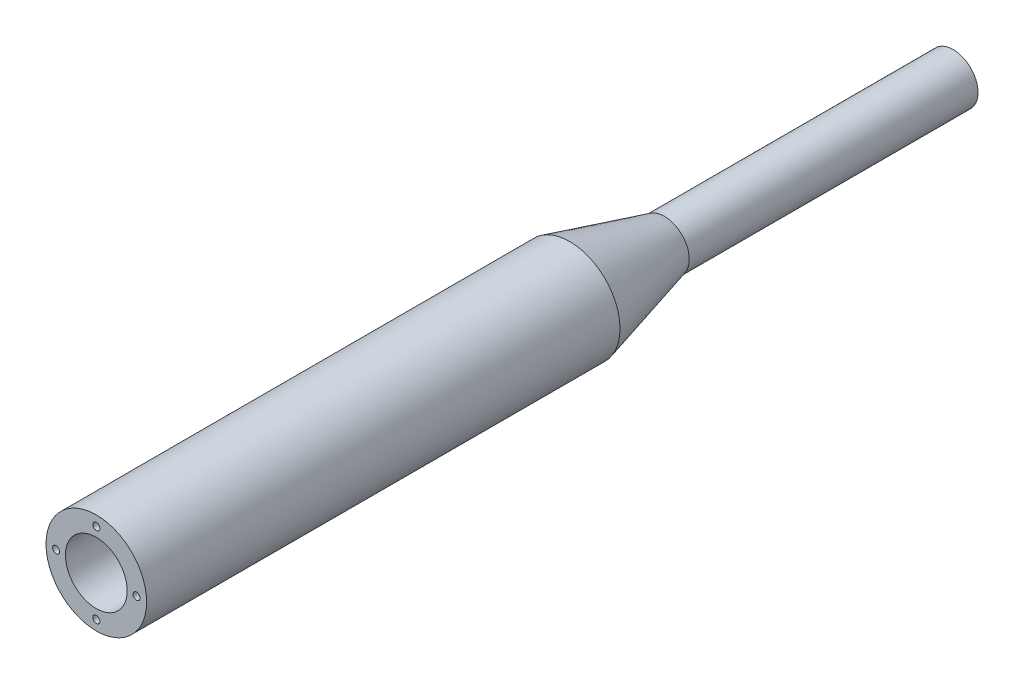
ISO-10303-21;
HEADER;
FILE_DESCRIPTION(('STEP AP214'),'2;1');
FILE_NAME('part.step','',(''),(''),'','','');
FILE_SCHEMA(('AUTOMOTIVE_DESIGN { 1 0 10303 214 1 1 1 1 }'));
ENDSEC;
DATA;
#1=APPLICATION_CONTEXT('core data for automotive mechanical design processes');
#2=APPLICATION_PROTOCOL_DEFINITION('international standard','automotive_design',2000,#1);
#3=PRODUCT_CONTEXT('',#1,'mechanical');
#4=PRODUCT('Part','Part','',(#3));
#5=PRODUCT_RELATED_PRODUCT_CATEGORY('part','',(#4));
#6=PRODUCT_DEFINITION_FORMATION('','',#4);
#7=PRODUCT_DEFINITION_CONTEXT('part definition',#1,'design');
#8=PRODUCT_DEFINITION('design','',#6,#7);
#9=PRODUCT_DEFINITION_SHAPE('','',#8);
#10=(LENGTH_UNIT() NAMED_UNIT(*) SI_UNIT(.MILLI.,.METRE.));
#11=(NAMED_UNIT(*) PLANE_ANGLE_UNIT() SI_UNIT($,.RADIAN.));
#12=(NAMED_UNIT(*) SI_UNIT($,.STERADIAN.) SOLID_ANGLE_UNIT());
#13=UNCERTAINTY_MEASURE_WITH_UNIT(LENGTH_MEASURE(1.E-05),#10,'distance_accuracy_value','');
#14=(GEOMETRIC_REPRESENTATION_CONTEXT(3) GLOBAL_UNCERTAINTY_ASSIGNED_CONTEXT((#13)) GLOBAL_UNIT_ASSIGNED_CONTEXT((#10,
#11,#12)) REPRESENTATION_CONTEXT('',''));
#15=CARTESIAN_POINT('',(0.,0.,0.));
#16=DIRECTION('',(0.,0.,1.));
#17=DIRECTION('',(1.,0.,0.));
#18=AXIS2_PLACEMENT_3D('',#15,#16,#17);
#19=CARTESIAN_POINT('',(0.,0.,254.));
#20=DIRECTION('',(0.,0.,1.));
#21=DIRECTION('',(1.,0.,0.));
#22=AXIS2_PLACEMENT_3D('',#19,#20,#21);
#23=CYLINDRICAL_SURFACE('',#22,15.875);
#24=CARTESIAN_POINT('',(0.,0.,0.));
#25=DIRECTION('',(0.,0.,1.));
#26=DIRECTION('',(1.,0.,0.));
#27=AXIS2_PLACEMENT_3D('',#24,#25,#26);
#28=CIRCLE('',#27,15.875);
#29=CARTESIAN_POINT('',(15.875,0.,0.));
#30=VERTEX_POINT('',#29);
#31=EDGE_CURVE('E98',#30,#30,#28,.T.);
#32=ORIENTED_EDGE('',*,*,#31,.F.);
#33=EDGE_LOOP('',(#32));
#34=FACE_BOUND('',#33,.T.);
#35=CARTESIAN_POINT('',(0.,0.,228.6));
#36=DIRECTION('',(0.,0.,1.));
#37=DIRECTION('',(1.,0.,0.));
#38=AXIS2_PLACEMENT_3D('',#35,#36,#37);
#39=CIRCLE('',#38,15.875);
#40=CARTESIAN_POINT('',(15.875,0.,228.6));
#41=VERTEX_POINT('',#40);
#42=EDGE_CURVE('E40',#41,#41,#39,.F.);
#43=ORIENTED_EDGE('',*,*,#42,.F.);
#44=EDGE_LOOP('',(#43));
#45=FACE_BOUND('',#44,.T.);
#46=ADVANCED_FACE('F36',(#34,#45),#23,.F.);
#47=CARTESIAN_POINT('',(0.,0.,254.));
#48=DIRECTION('',(0.,0.,-1.));
#49=DIRECTION('',(-1.,0.,0.));
#50=AXIS2_PLACEMENT_3D('',#47,#48,#49);
#51=CYLINDRICAL_SURFACE('',#50,26.9875);
#52=CARTESIAN_POINT('',(0.,0.,254.));
#53=DIRECTION('',(0.,0.,1.));
#54=DIRECTION('',(1.,0.,0.));
#55=AXIS2_PLACEMENT_3D('',#52,#53,#54);
#56=CIRCLE('',#55,26.9875);
#57=CARTESIAN_POINT('',(26.9875,0.,254.));
#58=VERTEX_POINT('',#57);
#59=EDGE_CURVE('E11',#58,#58,#56,.T.);
#60=ORIENTED_EDGE('',*,*,#59,.F.);
#61=EDGE_LOOP('',(#60));
#62=FACE_BOUND('',#61,.T.);
#63=CARTESIAN_POINT('',(0.,0.,0.));
#64=DIRECTION('',(0.,0.,-1.));
#65=DIRECTION('',(-1.,0.,0.));
#66=AXIS2_PLACEMENT_3D('',#63,#64,#65);
#67=CIRCLE('',#66,26.9875);
#68=CARTESIAN_POINT('',(-26.9875,0.,0.));
#69=VERTEX_POINT('',#68);
#70=EDGE_CURVE('E108',#69,#69,#67,.T.);
#71=ORIENTED_EDGE('',*,*,#70,.F.);
#72=EDGE_LOOP('',(#71));
#73=FACE_BOUND('',#72,.T.);
#74=ADVANCED_FACE('F38',(#62,#73),#51,.T.);
#75=CARTESIAN_POINT('',(0.,0.,254.));
#76=DIRECTION('',(0.,0.,1.));
#77=DIRECTION('',(1.,0.,0.));
#78=AXIS2_PLACEMENT_3D('',#75,#76,#77);
#79=PLANE('',#78);
#80=CARTESIAN_POINT('',(0.,21.59,254.));
#81=DIRECTION('',(0.,0.,1.));
#82=DIRECTION('',(1.,0.,0.));
#83=AXIS2_PLACEMENT_3D('',#80,#81,#82);
#84=CIRCLE('',#83,1.89865);
#85=CARTESIAN_POINT('',(1.89865,21.59,254.));
#86=VERTEX_POINT('',#85);
#87=EDGE_CURVE('E70',#86,#86,#84,.T.);
#88=ORIENTED_EDGE('',*,*,#87,.F.);
#89=EDGE_LOOP('',(#88));
#90=FACE_BOUND('',#89,.T.);
#91=CARTESIAN_POINT('',(-21.59,0.,254.));
#92=DIRECTION('',(0.,0.,1.));
#93=DIRECTION('',(1.,0.,0.));
#94=AXIS2_PLACEMENT_3D('',#91,#92,#93);
#95=CIRCLE('',#94,1.89864999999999);
#96=CARTESIAN_POINT('',(-19.69135,0.,254.));
#97=VERTEX_POINT('',#96);
#98=EDGE_CURVE('E69',#97,#97,#95,.T.);
#99=ORIENTED_EDGE('',*,*,#98,.F.);
#100=EDGE_LOOP('',(#99));
#101=FACE_BOUND('',#100,.T.);
#102=CARTESIAN_POINT('',(0.,-21.59,254.));
#103=DIRECTION('',(0.,0.,1.));
#104=DIRECTION('',(1.,0.,0.));
#105=AXIS2_PLACEMENT_3D('',#102,#103,#104);
#106=CIRCLE('',#105,1.89865);
#107=CARTESIAN_POINT('',(1.89865,-21.59,254.));
#108=VERTEX_POINT('',#107);
#109=EDGE_CURVE('E80',#108,#108,#106,.T.);
#110=ORIENTED_EDGE('',*,*,#109,.F.);
#111=EDGE_LOOP('',(#110));
#112=FACE_BOUND('',#111,.T.);
#113=CARTESIAN_POINT('',(21.59,0.,254.));
#114=DIRECTION('',(0.,0.,1.));
#115=DIRECTION('',(1.,0.,0.));
#116=AXIS2_PLACEMENT_3D('',#113,#114,#115);
#117=CIRCLE('',#116,1.89864999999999);
#118=CARTESIAN_POINT('',(23.48865,0.,254.));
#119=VERTEX_POINT('',#118);
#120=EDGE_CURVE('E86',#119,#119,#117,.T.);
#121=ORIENTED_EDGE('',*,*,#120,.F.);
#122=EDGE_LOOP('',(#121));
#123=FACE_BOUND('',#122,.T.);
#124=CARTESIAN_POINT('',(0.,0.,254.));
#125=DIRECTION('',(0.,0.,1.));
#126=DIRECTION('',(1.,0.,0.));
#127=AXIS2_PLACEMENT_3D('',#124,#125,#126);
#128=CIRCLE('',#127,16.5735);
#129=CARTESIAN_POINT('',(16.5735,0.,254.));
#130=VERTEX_POINT('',#129);
#131=EDGE_CURVE('E92',#130,#130,#128,.T.);
#132=ORIENTED_EDGE('',*,*,#131,.F.);
#133=EDGE_LOOP('',(#132));
#134=FACE_BOUND('',#133,.T.);
#135=ORIENTED_EDGE('',*,*,#59,.T.);
#136=EDGE_LOOP('',(#135));
#137=FACE_BOUND('',#136,.T.);
#138=ADVANCED_FACE('F136',(#90,#101,#112,#123,#134,#137),#79,.T.);
#139=CARTESIAN_POINT('',(0.,0.,-50.8));
#140=DIRECTION('',(0.,0.,1.));
#141=DIRECTION('',(1.,0.,0.));
#142=AXIS2_PLACEMENT_3D('',#139,#140,#141);
#143=CONICAL_SURFACE('',#142,13.335,0.262546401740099);
#144=ORIENTED_EDGE('',*,*,#70,.T.);
#145=EDGE_LOOP('',(#144));
#146=FACE_BOUND('',#145,.T.);
#147=CARTESIAN_POINT('',(0.,0.,-50.8));
#148=DIRECTION('',(0.,0.,-1.));
#149=DIRECTION('',(-1.,0.,0.));
#150=AXIS2_PLACEMENT_3D('',#147,#148,#149);
#151=CIRCLE('',#150,13.335);
#152=CARTESIAN_POINT('',(-13.335,0.,-50.8));
#153=VERTEX_POINT('',#152);
#154=EDGE_CURVE('E45',#153,#153,#151,.T.);
#155=ORIENTED_EDGE('',*,*,#154,.F.);
#156=EDGE_LOOP('',(#155));
#157=FACE_BOUND('',#156,.T.);
#158=ADVANCED_FACE('F127',(#146,#157),#143,.T.);
#159=CARTESIAN_POINT('',(0.,0.,-205.74));
#160=DIRECTION('',(0.,0.,-1.));
#161=DIRECTION('',(-1.,0.,0.));
#162=AXIS2_PLACEMENT_3D('',#159,#160,#161);
#163=PLANE('',#162);
#164=CARTESIAN_POINT('',(0.,0.,-205.74));
#165=DIRECTION('',(0.,0.,-1.));
#166=DIRECTION('',(-1.,0.,0.));
#167=AXIS2_PLACEMENT_3D('',#164,#165,#166);
#168=CIRCLE('',#167,13.335);
#169=CARTESIAN_POINT('',(-13.335,0.,-205.74));
#170=VERTEX_POINT('',#169);
#171=EDGE_CURVE('E105',#170,#170,#168,.T.);
#172=ORIENTED_EDGE('',*,*,#171,.T.);
#173=EDGE_LOOP('',(#172));
#174=FACE_BOUND('',#173,.T.);
#175=CARTESIAN_POINT('',(0.,0.,-205.74));
#176=DIRECTION('',(0.,0.,-1.));
#177=DIRECTION('',(-1.,0.,0.));
#178=AXIS2_PLACEMENT_3D('',#175,#176,#177);
#179=CIRCLE('',#178,6.35);
#180=CARTESIAN_POINT('',(-6.35,0.,-205.74));
#181=VERTEX_POINT('',#180);
#182=EDGE_CURVE('E102',#181,#181,#179,.T.);
#183=ORIENTED_EDGE('',*,*,#182,.F.);
#184=EDGE_LOOP('',(#183));
#185=FACE_BOUND('',#184,.T.);
#186=ADVANCED_FACE('F125',(#174,#185),#163,.T.);
#187=CARTESIAN_POINT('',(0.,0.,-205.74));
#188=DIRECTION('',(0.,0.,1.));
#189=DIRECTION('',(1.,0.,0.));
#190=AXIS2_PLACEMENT_3D('',#187,#188,#189);
#191=CYLINDRICAL_SURFACE('',#190,13.335);
#192=ORIENTED_EDGE('',*,*,#154,.T.);
#193=EDGE_LOOP('',(#192));
#194=FACE_BOUND('',#193,.T.);
#195=ORIENTED_EDGE('',*,*,#171,.F.);
#196=EDGE_LOOP('',(#195));
#197=FACE_BOUND('',#196,.T.);
#198=ADVANCED_FACE('F121',(#194,#197),#191,.T.);
#199=CARTESIAN_POINT('',(0.,0.,-205.74));
#200=DIRECTION('',(0.,0.,1.));
#201=DIRECTION('',(1.,0.,0.));
#202=AXIS2_PLACEMENT_3D('',#199,#200,#201);
#203=CYLINDRICAL_SURFACE('',#202,6.35);
#204=CARTESIAN_POINT('',(0.,0.,-5.72319739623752));
#205=DIRECTION('',(0.,0.,1.));
#206=DIRECTION('',(1.,0.,0.));
#207=AXIS2_PLACEMENT_3D('',#204,#205,#206);
#208=CIRCLE('',#207,6.35);
#209=CARTESIAN_POINT('',(6.35,0.,-5.72319739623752));
#210=VERTEX_POINT('',#209);
#211=EDGE_CURVE('E101',#210,#210,#208,.F.);
#212=ORIENTED_EDGE('',*,*,#211,.F.);
#213=EDGE_LOOP('',(#212));
#214=FACE_BOUND('',#213,.T.);
#215=ORIENTED_EDGE('',*,*,#182,.T.);
#216=EDGE_LOOP('',(#215));
#217=FACE_BOUND('',#216,.T.);
#218=ADVANCED_FACE('F118',(#214,#217),#203,.F.);
#219=CARTESIAN_POINT('',(0.,0.,0.));
#220=DIRECTION('',(0.,0.,1.));
#221=DIRECTION('',(1.,0.,0.));
#222=AXIS2_PLACEMENT_3D('',#219,#220,#221);
#223=CONICAL_SURFACE('',#222,15.875,1.02974425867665);
#224=ORIENTED_EDGE('',*,*,#211,.T.);
#225=EDGE_LOOP('',(#224));
#226=FACE_BOUND('',#225,.T.);
#227=ORIENTED_EDGE('',*,*,#31,.T.);
#228=EDGE_LOOP('',(#227));
#229=FACE_BOUND('',#228,.T.);
#230=ADVANCED_FACE('F115',(#226,#229),#223,.F.);
#231=CARTESIAN_POINT('',(0.,0.,228.6));
#232=DIRECTION('',(0.,0.,1.));
#233=DIRECTION('',(1.,0.,0.));
#234=AXIS2_PLACEMENT_3D('',#231,#232,#233);
#235=PLANE('',#234);
#236=CARTESIAN_POINT('',(0.,0.,228.6));
#237=DIRECTION('',(0.,0.,1.));
#238=DIRECTION('',(1.,0.,0.));
#239=AXIS2_PLACEMENT_3D('',#236,#237,#238);
#240=CIRCLE('',#239,16.5735);
#241=CARTESIAN_POINT('',(16.5735,0.,228.6));
#242=VERTEX_POINT('',#241);
#243=EDGE_CURVE('E93',#242,#242,#240,.T.);
#244=ORIENTED_EDGE('',*,*,#243,.T.);
#245=EDGE_LOOP('',(#244));
#246=FACE_BOUND('',#245,.T.);
#247=ORIENTED_EDGE('',*,*,#42,.T.);
#248=EDGE_LOOP('',(#247));
#249=FACE_BOUND('',#248,.T.);
#250=ADVANCED_FACE('F153',(#246,#249),#235,.T.);
#251=CARTESIAN_POINT('',(0.,0.,228.6));
#252=DIRECTION('',(0.,0.,1.));
#253=DIRECTION('',(1.,0.,0.));
#254=AXIS2_PLACEMENT_3D('',#251,#252,#253);
#255=CYLINDRICAL_SURFACE('',#254,16.5735);
#256=ORIENTED_EDGE('',*,*,#243,.F.);
#257=EDGE_LOOP('',(#256));
#258=FACE_BOUND('',#257,.T.);
#259=ORIENTED_EDGE('',*,*,#131,.T.);
#260=EDGE_LOOP('',(#259));
#261=FACE_BOUND('',#260,.T.);
#262=ADVANCED_FACE('F150',(#258,#261),#255,.F.);
#263=CARTESIAN_POINT('',(21.59,0.,228.6));
#264=DIRECTION('',(0.,0.,1.));
#265=DIRECTION('',(1.,0.,0.));
#266=AXIS2_PLACEMENT_3D('',#263,#264,#265);
#267=CONICAL_SURFACE('',#266,1.89864999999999,1.02974425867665);
#268=CARTESIAN_POINT('',(21.59,0.,227.459175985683));
#269=VERTEX_POINT('',#268);
#270=VERTEX_LOOP('',#269);
#271=FACE_BOUND('',#270,.T.);
#272=CARTESIAN_POINT('',(21.59,0.,228.6));
#273=DIRECTION('',(0.,0.,1.));
#274=DIRECTION('',(1.,0.,0.));
#275=AXIS2_PLACEMENT_3D('',#272,#273,#274);
#276=CIRCLE('',#275,1.89864999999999);
#277=CARTESIAN_POINT('',(23.48865,0.,228.6));
#278=VERTEX_POINT('',#277);
#279=EDGE_CURVE('E89',#278,#278,#276,.T.);
#280=ORIENTED_EDGE('',*,*,#279,.T.);
#281=EDGE_LOOP('',(#280));
#282=FACE_BOUND('',#281,.T.);
#283=ADVANCED_FACE('F161',(#271,#282),#267,.F.);
#284=CARTESIAN_POINT('',(21.59,0.,254.));
#285=DIRECTION('',(0.,0.,1.));
#286=DIRECTION('',(1.,0.,0.));
#287=AXIS2_PLACEMENT_3D('',#284,#285,#286);
#288=CYLINDRICAL_SURFACE('',#287,1.89864999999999);
#289=ORIENTED_EDGE('',*,*,#279,.F.);
#290=EDGE_LOOP('',(#289));
#291=FACE_BOUND('',#290,.T.);
#292=ORIENTED_EDGE('',*,*,#120,.T.);
#293=EDGE_LOOP('',(#292));
#294=FACE_BOUND('',#293,.T.);
#295=ADVANCED_FACE('F167',(#291,#294),#288,.F.);
#296=CARTESIAN_POINT('',(0.,-21.59,228.6));
#297=DIRECTION('',(0.,0.,1.));
#298=DIRECTION('',(1.,0.,0.));
#299=AXIS2_PLACEMENT_3D('',#296,#297,#298);
#300=CONICAL_SURFACE('',#299,1.89864999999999,1.02974425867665);
#301=CARTESIAN_POINT('',(0.,-21.59,227.459175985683));
#302=VERTEX_POINT('',#301);
#303=VERTEX_LOOP('',#302);
#304=FACE_BOUND('',#303,.T.);
#305=CARTESIAN_POINT('',(0.,-21.59,228.6));
#306=DIRECTION('',(0.,0.,1.));
#307=DIRECTION('',(1.,0.,0.));
#308=AXIS2_PLACEMENT_3D('',#305,#306,#307);
#309=CIRCLE('',#308,1.89864999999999);
#310=CARTESIAN_POINT('',(1.89864999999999,-21.59,228.6));
#311=VERTEX_POINT('',#310);
#312=EDGE_CURVE('E83',#311,#311,#309,.T.);
#313=ORIENTED_EDGE('',*,*,#312,.T.);
#314=EDGE_LOOP('',(#313));
#315=FACE_BOUND('',#314,.T.);
#316=ADVANCED_FACE('F170',(#304,#315),#300,.F.);
#317=CARTESIAN_POINT('',(0.,-21.59,254.));
#318=DIRECTION('',(0.,0.,1.));
#319=DIRECTION('',(1.,0.,0.));
#320=AXIS2_PLACEMENT_3D('',#317,#318,#319);
#321=CYLINDRICAL_SURFACE('',#320,1.89865);
#322=ORIENTED_EDGE('',*,*,#312,.F.);
#323=EDGE_LOOP('',(#322));
#324=FACE_BOUND('',#323,.T.);
#325=ORIENTED_EDGE('',*,*,#109,.T.);
#326=EDGE_LOOP('',(#325));
#327=FACE_BOUND('',#326,.T.);
#328=ADVANCED_FACE('F174',(#324,#327),#321,.F.);
#329=CARTESIAN_POINT('',(-21.59,0.,228.6));
#330=DIRECTION('',(0.,0.,1.));
#331=DIRECTION('',(1.,0.,0.));
#332=AXIS2_PLACEMENT_3D('',#329,#330,#331);
#333=CONICAL_SURFACE('',#332,1.89864999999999,1.02974425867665);
#334=CARTESIAN_POINT('',(-21.59,0.,227.459175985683));
#335=VERTEX_POINT('',#334);
#336=VERTEX_LOOP('',#335);
#337=FACE_BOUND('',#336,.T.);
#338=CARTESIAN_POINT('',(-21.59,0.,228.6));
#339=DIRECTION('',(0.,0.,1.));
#340=DIRECTION('',(1.,0.,0.));
#341=AXIS2_PLACEMENT_3D('',#338,#339,#340);
#342=CIRCLE('',#341,1.89864999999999);
#343=CARTESIAN_POINT('',(-19.69135,0.,228.6));
#344=VERTEX_POINT('',#343);
#345=EDGE_CURVE('E73',#344,#344,#342,.T.);
#346=ORIENTED_EDGE('',*,*,#345,.T.);
#347=EDGE_LOOP('',(#346));
#348=FACE_BOUND('',#347,.T.);
#349=ADVANCED_FACE('F177',(#337,#348),#333,.F.);
#350=CARTESIAN_POINT('',(-21.59,0.,254.));
#351=DIRECTION('',(0.,0.,1.));
#352=DIRECTION('',(1.,0.,0.));
#353=AXIS2_PLACEMENT_3D('',#350,#351,#352);
#354=CYLINDRICAL_SURFACE('',#353,1.89864999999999);
#355=ORIENTED_EDGE('',*,*,#345,.F.);
#356=EDGE_LOOP('',(#355));
#357=FACE_BOUND('',#356,.T.);
#358=ORIENTED_EDGE('',*,*,#98,.T.);
#359=EDGE_LOOP('',(#358));
#360=FACE_BOUND('',#359,.T.);
#361=ADVANCED_FACE('F63',(#357,#360),#354,.F.);
#362=CARTESIAN_POINT('',(0.,21.59,228.6));
#363=DIRECTION('',(0.,0.,1.));
#364=DIRECTION('',(1.,0.,0.));
#365=AXIS2_PLACEMENT_3D('',#362,#363,#364);
#366=CONICAL_SURFACE('',#365,1.89864999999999,1.02974425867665);
#367=CARTESIAN_POINT('',(0.,21.59,227.459175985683));
#368=VERTEX_POINT('',#367);
#369=VERTEX_LOOP('',#368);
#370=FACE_BOUND('',#369,.T.);
#371=CARTESIAN_POINT('',(0.,21.59,228.6));
#372=DIRECTION('',(0.,0.,1.));
#373=DIRECTION('',(1.,0.,0.));
#374=AXIS2_PLACEMENT_3D('',#371,#372,#373);
#375=CIRCLE('',#374,1.89864999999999);
#376=CARTESIAN_POINT('',(1.89864999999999,21.59,228.6));
#377=VERTEX_POINT('',#376);
#378=EDGE_CURVE('E67',#377,#377,#375,.T.);
#379=ORIENTED_EDGE('',*,*,#378,.T.);
#380=EDGE_LOOP('',(#379));
#381=FACE_BOUND('',#380,.T.);
#382=ADVANCED_FACE('F59',(#370,#381),#366,.F.);
#383=CARTESIAN_POINT('',(0.,21.59,254.));
#384=DIRECTION('',(0.,0.,1.));
#385=DIRECTION('',(1.,0.,0.));
#386=AXIS2_PLACEMENT_3D('',#383,#384,#385);
#387=CYLINDRICAL_SURFACE('',#386,1.89865);
#388=ORIENTED_EDGE('',*,*,#378,.F.);
#389=EDGE_LOOP('',(#388));
#390=FACE_BOUND('',#389,.T.);
#391=ORIENTED_EDGE('',*,*,#87,.T.);
#392=EDGE_LOOP('',(#391));
#393=FACE_BOUND('',#392,.T.);
#394=ADVANCED_FACE('F62',(#390,#393),#387,.F.);
#395=CLOSED_SHELL('',(#46,#74,#138,#158,#186,#198,#218,#230,#250,#262,#283,#295,#316,#328,#349,
#361,#382,#394));
#396=MANIFOLD_SOLID_BREP('B2',#395);
#397=ADVANCED_BREP_SHAPE_REPRESENTATION('',(#18,#396),#14);
#398=SHAPE_DEFINITION_REPRESENTATION(#9,#397);
ENDSEC;
END-ISO-10303-21;
